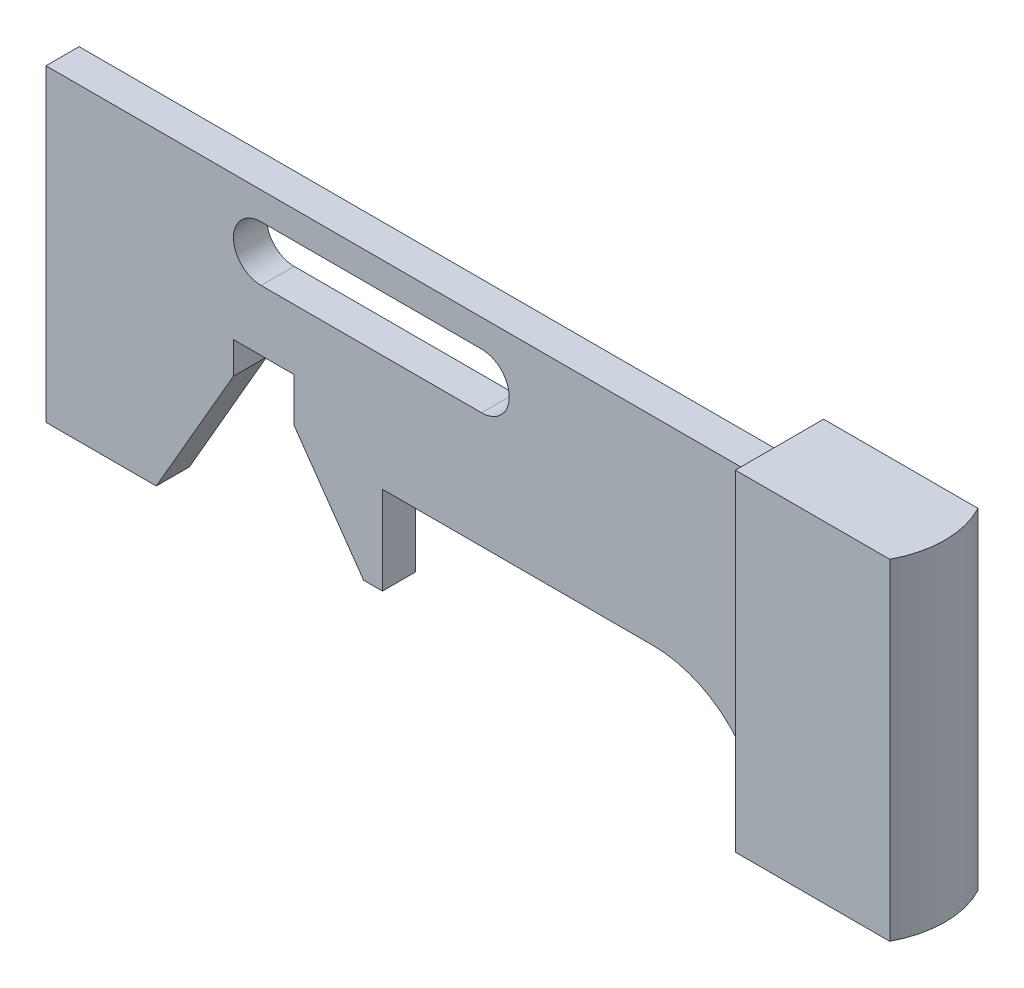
ISO-10303-21;
HEADER;
FILE_DESCRIPTION(('STEP AP214'),'2;1');
FILE_NAME('part.step','',(''),(''),'','','');
FILE_SCHEMA(('AUTOMOTIVE_DESIGN { 1 0 10303 214 1 1 1 1 }'));
ENDSEC;
DATA;
#1=APPLICATION_CONTEXT('core data for automotive mechanical design processes');
#2=APPLICATION_PROTOCOL_DEFINITION('international standard','automotive_design',2000,#1);
#3=PRODUCT_CONTEXT('',#1,'mechanical');
#4=PRODUCT('Part','Part','',(#3));
#5=PRODUCT_RELATED_PRODUCT_CATEGORY('part','',(#4));
#6=PRODUCT_DEFINITION_FORMATION('','',#4);
#7=PRODUCT_DEFINITION_CONTEXT('part definition',#1,'design');
#8=PRODUCT_DEFINITION('design','',#6,#7);
#9=PRODUCT_DEFINITION_SHAPE('','',#8);
#10=(LENGTH_UNIT() NAMED_UNIT(*) SI_UNIT(.MILLI.,.METRE.));
#11=(NAMED_UNIT(*) PLANE_ANGLE_UNIT() SI_UNIT($,.RADIAN.));
#12=(NAMED_UNIT(*) SI_UNIT($,.STERADIAN.) SOLID_ANGLE_UNIT());
#13=UNCERTAINTY_MEASURE_WITH_UNIT(LENGTH_MEASURE(1.E-05),#10,'distance_accuracy_value','');
#14=(GEOMETRIC_REPRESENTATION_CONTEXT(3) GLOBAL_UNCERTAINTY_ASSIGNED_CONTEXT((#13)) GLOBAL_UNIT_ASSIGNED_CONTEXT((#10,
#11,#12)) REPRESENTATION_CONTEXT('',''));
#15=CARTESIAN_POINT('',(0.,0.,0.));
#16=DIRECTION('',(0.,0.,1.));
#17=DIRECTION('',(1.,0.,0.));
#18=AXIS2_PLACEMENT_3D('',#15,#16,#17);
#19=CARTESIAN_POINT('',(71.5,0.,0.));
#20=DIRECTION('',(0.,-1.,0.));
#21=DIRECTION('',(0.,0.,-1.));
#22=AXIS2_PLACEMENT_3D('',#19,#20,#21);
#23=PLANE('',#22);
#24=DIRECTION('',(0.,0.,1.));
#25=VECTOR('',#24,1.);
#26=CARTESIAN_POINT('',(10.,0.,-1.5));
#27=LINE('',#26,#25);
#28=CARTESIAN_POINT('',(10.,0.,-1.5));
#29=VERTEX_POINT('',#28);
#30=CARTESIAN_POINT('',(10.,0.,1.5));
#31=VERTEX_POINT('',#30);
#32=EDGE_CURVE('E250',#29,#31,#27,.T.);
#33=ORIENTED_EDGE('',*,*,#32,.T.);
#34=DIRECTION('',(1.,0.,0.));
#35=VECTOR('',#34,1.);
#36=CARTESIAN_POINT('',(0.,0.,1.5));
#37=LINE('',#36,#35);
#38=CARTESIAN_POINT('',(0.,0.,1.5));
#39=VERTEX_POINT('',#38);
#40=EDGE_CURVE('E318',#39,#31,#37,.T.);
#41=ORIENTED_EDGE('',*,*,#40,.F.);
#42=DIRECTION('',(0.,0.,1.));
#43=VECTOR('',#42,1.);
#44=CARTESIAN_POINT('',(0.,0.,1.5));
#45=LINE('',#44,#43);
#46=CARTESIAN_POINT('',(0.,0.,-1.5));
#47=VERTEX_POINT('',#46);
#48=EDGE_CURVE('E299',#47,#39,#45,.T.);
#49=ORIENTED_EDGE('',*,*,#48,.F.);
#50=DIRECTION('',(-1.,0.,0.));
#51=VECTOR('',#50,1.);
#52=CARTESIAN_POINT('',(0.,0.,-1.5));
#53=LINE('',#52,#51);
#54=EDGE_CURVE('E308',#29,#47,#53,.T.);
#55=ORIENTED_EDGE('',*,*,#54,.F.);
#56=EDGE_LOOP('',(#33,#41,#49,#55));
#57=FACE_BOUND('',#56,.T.);
#58=ADVANCED_FACE('F37',(#57),#23,.T.);
#59=CARTESIAN_POINT('',(0.,30.,1.5));
#60=DIRECTION('',(1.,0.,0.));
#61=DIRECTION('',(0.,0.,-1.));
#62=AXIS2_PLACEMENT_3D('',#59,#60,#61);
#63=PLANE('',#62);
#64=DIRECTION('',(0.,-1.,0.));
#65=VECTOR('',#64,1.);
#66=CARTESIAN_POINT('',(0.,30.,1.5));
#67=LINE('',#66,#65);
#68=CARTESIAN_POINT('',(0.,28.,1.5));
#69=VERTEX_POINT('',#68);
#70=EDGE_CURVE('E11',#69,#39,#67,.T.);
#71=ORIENTED_EDGE('',*,*,#70,.F.);
#72=DIRECTION('',(0.,0.,1.));
#73=VECTOR('',#72,1.);
#74=CARTESIAN_POINT('',(0.,28.,-1.5));
#75=LINE('',#74,#73);
#76=CARTESIAN_POINT('',(0.,28.,-1.5));
#77=VERTEX_POINT('',#76);
#78=EDGE_CURVE('E270',#77,#69,#75,.T.);
#79=ORIENTED_EDGE('',*,*,#78,.F.);
#80=DIRECTION('',(0.,-1.,0.));
#81=VECTOR('',#80,1.);
#82=CARTESIAN_POINT('',(0.,30.,-1.5));
#83=LINE('',#82,#81);
#84=EDGE_CURVE('E315',#77,#47,#83,.T.);
#85=ORIENTED_EDGE('',*,*,#84,.T.);
#86=ORIENTED_EDGE('',*,*,#48,.T.);
#87=EDGE_LOOP('',(#71,#79,#85,#86));
#88=FACE_BOUND('',#87,.T.);
#89=ADVANCED_FACE('F39',(#88),#63,.F.);
#90=CARTESIAN_POINT('',(0.,30.,1.5));
#91=DIRECTION('',(0.,0.,-1.));
#92=DIRECTION('',(-1.,0.,0.));
#93=AXIS2_PLACEMENT_3D('',#90,#91,#92);
#94=PLANE('',#93);
#95=DIRECTION('',(1.,0.,0.));
#96=VECTOR('',#95,1.);
#97=CARTESIAN_POINT('',(19.5,20.5,1.5));
#98=LINE('',#97,#96);
#99=CARTESIAN_POINT('',(19.5,20.5,1.5));
#100=VERTEX_POINT('',#99);
#101=CARTESIAN_POINT('',(39.5,20.5,1.5));
#102=VERTEX_POINT('',#101);
#103=EDGE_CURVE('E289',#100,#102,#98,.T.);
#104=ORIENTED_EDGE('',*,*,#103,.F.);
#105=CARTESIAN_POINT('',(19.5,23.,1.5));
#106=DIRECTION('',(0.,0.,1.));
#107=DIRECTION('',(1.,0.,0.));
#108=AXIS2_PLACEMENT_3D('',#105,#106,#107);
#109=CIRCLE('',#108,2.5);
#110=CARTESIAN_POINT('',(19.5,25.5,1.5));
#111=VERTEX_POINT('',#110);
#112=EDGE_CURVE('E52',#111,#100,#109,.T.);
#113=ORIENTED_EDGE('',*,*,#112,.F.);
#114=DIRECTION('',(-1.,0.,0.));
#115=VECTOR('',#114,1.);
#116=CARTESIAN_POINT('',(19.5,25.5,1.5));
#117=LINE('',#116,#115);
#118=CARTESIAN_POINT('',(39.5,25.5,1.5));
#119=VERTEX_POINT('',#118);
#120=EDGE_CURVE('E280',#119,#111,#117,.T.);
#121=ORIENTED_EDGE('',*,*,#120,.F.);
#122=CARTESIAN_POINT('',(39.5,23.,1.5));
#123=DIRECTION('',(0.,0.,1.));
#124=DIRECTION('',(1.,0.,0.));
#125=AXIS2_PLACEMENT_3D('',#122,#123,#124);
#126=CIRCLE('',#125,2.5);
#127=EDGE_CURVE('E292',#102,#119,#126,.T.);
#128=ORIENTED_EDGE('',*,*,#127,.F.);
#129=EDGE_LOOP('',(#104,#113,#121,#128));
#130=FACE_BOUND('',#129,.T.);
#131=ORIENTED_EDGE('',*,*,#40,.T.);
#132=DIRECTION('',(-0.499999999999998,-0.86602540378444,0.));
#133=VECTOR('',#132,1.);
#134=CARTESIAN_POINT('',(10.,0.,1.5));
#135=LINE('',#134,#133);
#136=CARTESIAN_POINT('',(17.,12.1243556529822,1.5));
#137=VERTEX_POINT('',#136);
#138=EDGE_CURVE('E207',#137,#31,#135,.T.);
#139=ORIENTED_EDGE('',*,*,#138,.F.);
#140=DIRECTION('',(0.,-1.,0.));
#141=VECTOR('',#140,1.);
#142=CARTESIAN_POINT('',(17.,12.1243556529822,1.5));
#143=LINE('',#142,#141);
#144=CARTESIAN_POINT('',(17.,15.,1.5));
#145=VERTEX_POINT('',#144);
#146=EDGE_CURVE('E209',#145,#137,#143,.T.);
#147=ORIENTED_EDGE('',*,*,#146,.F.);
#148=DIRECTION('',(-1.,0.,0.));
#149=VECTOR('',#148,1.);
#150=CARTESIAN_POINT('',(17.,15.,1.5));
#151=LINE('',#150,#149);
#152=CARTESIAN_POINT('',(22.5,15.,1.5));
#153=VERTEX_POINT('',#152);
#154=EDGE_CURVE('E245',#153,#145,#151,.T.);
#155=ORIENTED_EDGE('',*,*,#154,.F.);
#156=DIRECTION('',(0.,1.,0.));
#157=VECTOR('',#156,1.);
#158=CARTESIAN_POINT('',(22.5,15.,1.5));
#159=LINE('',#158,#157);
#160=CARTESIAN_POINT('',(22.5,10.9973324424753,1.5));
#161=VERTEX_POINT('',#160);
#162=EDGE_CURVE('E242',#161,#153,#159,.T.);
#163=ORIENTED_EDGE('',*,*,#162,.F.);
#164=DIRECTION('',(-0.573576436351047,0.819152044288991,0.));
#165=VECTOR('',#164,1.);
#166=CARTESIAN_POINT('',(22.5,10.9973324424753,1.5));
#167=LINE('',#166,#165);
#168=CARTESIAN_POINT('',(28.8,2.,1.5));
#169=VERTEX_POINT('',#168);
#170=EDGE_CURVE('E239',#169,#161,#167,.T.);
#171=ORIENTED_EDGE('',*,*,#170,.F.);
#172=DIRECTION('',(-1.,0.,0.));
#173=VECTOR('',#172,1.);
#174=CARTESIAN_POINT('',(28.8,2.,1.5));
#175=LINE('',#174,#173);
#176=CARTESIAN_POINT('',(30.5,2.,1.5));
#177=VERTEX_POINT('',#176);
#178=EDGE_CURVE('E236',#177,#169,#175,.T.);
#179=ORIENTED_EDGE('',*,*,#178,.F.);
#180=DIRECTION('',(0.,-1.,0.));
#181=VECTOR('',#180,1.);
#182=CARTESIAN_POINT('',(30.5,2.,1.5));
#183=LINE('',#182,#181);
#184=CARTESIAN_POINT('',(30.5,10.,1.5));
#185=VERTEX_POINT('',#184);
#186=EDGE_CURVE('E233',#185,#177,#183,.T.);
#187=ORIENTED_EDGE('',*,*,#186,.F.);
#188=DIRECTION('',(-1.,0.,0.));
#189=VECTOR('',#188,1.);
#190=CARTESIAN_POINT('',(30.5,10.,1.5));
#191=LINE('',#190,#189);
#192=CARTESIAN_POINT('',(55.,10.,1.5));
#193=VERTEX_POINT('',#192);
#194=EDGE_CURVE('E231',#193,#185,#191,.T.);
#195=ORIENTED_EDGE('',*,*,#194,.F.);
#196=CARTESIAN_POINT('',(55.,0.,1.5));
#197=DIRECTION('',(0.,0.,1.));
#198=DIRECTION('',(-1.,0.,0.));
#199=AXIS2_PLACEMENT_3D('',#196,#197,#198);
#200=CIRCLE('',#199,10.);
#201=CARTESIAN_POINT('',(65.,0.,1.5));
#202=VERTEX_POINT('',#201);
#203=EDGE_CURVE('E185',#202,#193,#200,.T.);
#204=ORIENTED_EDGE('',*,*,#203,.F.);
#205=DIRECTION('',(0.,-1.,0.));
#206=VECTOR('',#205,1.);
#207=CARTESIAN_POINT('',(65.,30.,1.5));
#208=LINE('',#207,#206);
#209=CARTESIAN_POINT('',(65.,28.,1.5));
#210=VERTEX_POINT('',#209);
#211=EDGE_CURVE('E45',#210,#202,#208,.T.);
#212=ORIENTED_EDGE('',*,*,#211,.F.);
#213=DIRECTION('',(1.,0.,0.));
#214=VECTOR('',#213,1.);
#215=CARTESIAN_POINT('',(0.,28.,1.5));
#216=LINE('',#215,#214);
#217=EDGE_CURVE('E253',#69,#210,#216,.T.);
#218=ORIENTED_EDGE('',*,*,#217,.F.);
#219=ORIENTED_EDGE('',*,*,#70,.T.);
#220=EDGE_LOOP('',(#131,#139,#147,#155,#163,#171,#179,#187,#195,#204,#212,#218,#219));
#221=FACE_BOUND('',#220,.T.);
#222=ADVANCED_FACE('F388',(#130,#221),#94,.F.);
#223=CARTESIAN_POINT('',(65.,30.,4.));
#224=DIRECTION('',(0.,0.,-1.));
#225=DIRECTION('',(-1.,0.,0.));
#226=AXIS2_PLACEMENT_3D('',#223,#224,#225);
#227=PLANE('',#226);
#228=DIRECTION('',(1.,0.,0.));
#229=VECTOR('',#228,1.);
#230=CARTESIAN_POINT('',(65.,0.,4.));
#231=LINE('',#230,#229);
#232=CARTESIAN_POINT('',(65.,0.,4.));
#233=VERTEX_POINT('',#232);
#234=CARTESIAN_POINT('',(79.,0.,4.));
#235=VERTEX_POINT('',#234);
#236=EDGE_CURVE('E323',#233,#235,#231,.T.);
#237=ORIENTED_EDGE('',*,*,#236,.T.);
#238=DIRECTION('',(0.,-1.,0.));
#239=VECTOR('',#238,1.);
#240=CARTESIAN_POINT('',(79.,30.,4.));
#241=LINE('',#240,#239);
#242=CARTESIAN_POINT('',(79.,30.,4.));
#243=VERTEX_POINT('',#242);
#244=EDGE_CURVE('E341',#243,#235,#241,.T.);
#245=ORIENTED_EDGE('',*,*,#244,.F.);
#246=DIRECTION('',(1.,0.,0.));
#247=VECTOR('',#246,1.);
#248=CARTESIAN_POINT('',(65.,30.,4.));
#249=LINE('',#248,#247);
#250=CARTESIAN_POINT('',(65.,30.,4.));
#251=VERTEX_POINT('',#250);
#252=EDGE_CURVE('E307',#251,#243,#249,.T.);
#253=ORIENTED_EDGE('',*,*,#252,.F.);
#254=DIRECTION('',(0.,-1.,0.));
#255=VECTOR('',#254,1.);
#256=CARTESIAN_POINT('',(65.,30.,4.));
#257=LINE('',#256,#255);
#258=EDGE_CURVE('E344',#251,#233,#257,.T.);
#259=ORIENTED_EDGE('',*,*,#258,.T.);
#260=EDGE_LOOP('',(#237,#245,#253,#259));
#261=FACE_BOUND('',#260,.T.);
#262=ADVANCED_FACE('F362',(#261),#227,.F.);
#263=CARTESIAN_POINT('',(71.5,30.,0.));
#264=DIRECTION('',(0.,-1.,0.));
#265=DIRECTION('',(0.,0.,-1.));
#266=AXIS2_PLACEMENT_3D('',#263,#264,#265);
#267=CYLINDRICAL_SURFACE('',#266,8.49999999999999);
#268=CARTESIAN_POINT('',(71.5,0.,0.));
#269=DIRECTION('',(0.,1.,0.));
#270=DIRECTION('',(0.,0.,-1.));
#271=AXIS2_PLACEMENT_3D('',#268,#269,#270);
#272=CIRCLE('',#271,8.49999999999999);
#273=CARTESIAN_POINT('',(79.,0.,-4.));
#274=VERTEX_POINT('',#273);
#275=EDGE_CURVE('E325',#235,#274,#272,.T.);
#276=ORIENTED_EDGE('',*,*,#275,.T.);
#277=DIRECTION('',(0.,-1.,0.));
#278=VECTOR('',#277,1.);
#279=CARTESIAN_POINT('',(79.,30.,-4.));
#280=LINE('',#279,#278);
#281=CARTESIAN_POINT('',(79.,30.,-4.));
#282=VERTEX_POINT('',#281);
#283=EDGE_CURVE('E338',#282,#274,#280,.T.);
#284=ORIENTED_EDGE('',*,*,#283,.F.);
#285=CARTESIAN_POINT('',(71.5,30.,0.));
#286=DIRECTION('',(0.,1.,0.));
#287=DIRECTION('',(0.,0.,-1.));
#288=AXIS2_PLACEMENT_3D('',#285,#286,#287);
#289=CIRCLE('',#288,8.49999999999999);
#290=EDGE_CURVE('E310',#243,#282,#289,.T.);
#291=ORIENTED_EDGE('',*,*,#290,.F.);
#292=ORIENTED_EDGE('',*,*,#244,.T.);
#293=EDGE_LOOP('',(#276,#284,#291,#292));
#294=FACE_BOUND('',#293,.T.);
#295=ADVANCED_FACE('F366',(#294),#267,.T.);
#296=CARTESIAN_POINT('',(65.,30.,-4.));
#297=DIRECTION('',(0.,0.,1.));
#298=DIRECTION('',(1.,0.,0.));
#299=AXIS2_PLACEMENT_3D('',#296,#297,#298);
#300=PLANE('',#299);
#301=DIRECTION('',(-1.,0.,0.));
#302=VECTOR('',#301,1.);
#303=CARTESIAN_POINT('',(65.,0.,-4.));
#304=LINE('',#303,#302);
#305=CARTESIAN_POINT('',(65.,0.,-4.));
#306=VERTEX_POINT('',#305);
#307=EDGE_CURVE('E327',#274,#306,#304,.T.);
#308=ORIENTED_EDGE('',*,*,#307,.T.);
#309=DIRECTION('',(0.,-1.,0.));
#310=VECTOR('',#309,1.);
#311=CARTESIAN_POINT('',(65.,30.,-4.));
#312=LINE('',#311,#310);
#313=CARTESIAN_POINT('',(65.,30.,-4.));
#314=VERTEX_POINT('',#313);
#315=EDGE_CURVE('E335',#314,#306,#312,.T.);
#316=ORIENTED_EDGE('',*,*,#315,.F.);
#317=DIRECTION('',(-1.,0.,0.));
#318=VECTOR('',#317,1.);
#319=CARTESIAN_POINT('',(65.,30.,-4.));
#320=LINE('',#319,#318);
#321=EDGE_CURVE('E312',#282,#314,#320,.T.);
#322=ORIENTED_EDGE('',*,*,#321,.F.);
#323=ORIENTED_EDGE('',*,*,#283,.T.);
#324=EDGE_LOOP('',(#308,#316,#322,#323));
#325=FACE_BOUND('',#324,.T.);
#326=ADVANCED_FACE('F373',(#325),#300,.F.);
#327=CARTESIAN_POINT('',(65.,30.,-1.5));
#328=DIRECTION('',(1.,0.,0.));
#329=DIRECTION('',(0.,0.,-1.));
#330=AXIS2_PLACEMENT_3D('',#327,#328,#329);
#331=PLANE('',#330);
#332=DIRECTION('',(0.,0.,1.));
#333=VECTOR('',#332,1.);
#334=CARTESIAN_POINT('',(65.,0.,-1.5));
#335=LINE('',#334,#333);
#336=CARTESIAN_POINT('',(65.,0.,-1.5));
#337=VERTEX_POINT('',#336);
#338=EDGE_CURVE('E329',#306,#337,#335,.T.);
#339=ORIENTED_EDGE('',*,*,#338,.T.);
#340=DIRECTION('',(0.,-1.,0.));
#341=VECTOR('',#340,1.);
#342=CARTESIAN_POINT('',(65.,30.,-1.5));
#343=LINE('',#342,#341);
#344=CARTESIAN_POINT('',(65.,28.,-1.5));
#345=VERTEX_POINT('',#344);
#346=EDGE_CURVE('E205',#345,#337,#343,.T.);
#347=ORIENTED_EDGE('',*,*,#346,.F.);
#348=DIRECTION('',(0.,0.,1.));
#349=VECTOR('',#348,1.);
#350=CARTESIAN_POINT('',(65.,28.,-1.5));
#351=LINE('',#350,#349);
#352=EDGE_CURVE('E273',#345,#210,#351,.T.);
#353=ORIENTED_EDGE('',*,*,#352,.T.);
#354=ORIENTED_EDGE('',*,*,#211,.T.);
#355=DIRECTION('',(0.,0.,1.));
#356=VECTOR('',#355,1.);
#357=CARTESIAN_POINT('',(65.,0.,1.5));
#358=LINE('',#357,#356);
#359=EDGE_CURVE('E321',#202,#233,#358,.T.);
#360=ORIENTED_EDGE('',*,*,#359,.T.);
#361=ORIENTED_EDGE('',*,*,#258,.F.);
#362=DIRECTION('',(0.,0.,1.));
#363=VECTOR('',#362,1.);
#364=CARTESIAN_POINT('',(65.,30.,1.5));
#365=LINE('',#364,#363);
#366=EDGE_CURVE('E305',#314,#251,#365,.T.);
#367=ORIENTED_EDGE('',*,*,#366,.F.);
#368=ORIENTED_EDGE('',*,*,#315,.T.);
#369=EDGE_LOOP('',(#339,#347,#353,#354,#360,#361,#367,#368));
#370=FACE_BOUND('',#369,.T.);
#371=ADVANCED_FACE('F350',(#370),#331,.F.);
#372=CARTESIAN_POINT('',(0.,30.,-1.5));
#373=DIRECTION('',(0.,0.,1.));
#374=DIRECTION('',(1.,0.,0.));
#375=AXIS2_PLACEMENT_3D('',#372,#373,#374);
#376=PLANE('',#375);
#377=DIRECTION('',(-1.,0.,0.));
#378=VECTOR('',#377,1.);
#379=CARTESIAN_POINT('',(19.5,25.5,-1.5));
#380=LINE('',#379,#378);
#381=CARTESIAN_POINT('',(39.5,25.5,-1.5));
#382=VERTEX_POINT('',#381);
#383=CARTESIAN_POINT('',(19.5,25.5,-1.5));
#384=VERTEX_POINT('',#383);
#385=EDGE_CURVE('E284',#382,#384,#380,.T.);
#386=ORIENTED_EDGE('',*,*,#385,.T.);
#387=CARTESIAN_POINT('',(19.5,23.,-1.5));
#388=DIRECTION('',(0.,0.,1.));
#389=DIRECTION('',(1.,0.,0.));
#390=AXIS2_PLACEMENT_3D('',#387,#388,#389);
#391=CIRCLE('',#390,2.5);
#392=CARTESIAN_POINT('',(19.5,20.5,-1.5));
#393=VERTEX_POINT('',#392);
#394=EDGE_CURVE('E276',#384,#393,#391,.T.);
#395=ORIENTED_EDGE('',*,*,#394,.T.);
#396=DIRECTION('',(1.,0.,0.));
#397=VECTOR('',#396,1.);
#398=CARTESIAN_POINT('',(19.5,20.5,-1.5));
#399=LINE('',#398,#397);
#400=CARTESIAN_POINT('',(39.5,20.5,-1.5));
#401=VERTEX_POINT('',#400);
#402=EDGE_CURVE('E279',#393,#401,#399,.T.);
#403=ORIENTED_EDGE('',*,*,#402,.T.);
#404=CARTESIAN_POINT('',(39.5,23.,-1.5));
#405=DIRECTION('',(0.,0.,1.));
#406=DIRECTION('',(1.,0.,0.));
#407=AXIS2_PLACEMENT_3D('',#404,#405,#406);
#408=CIRCLE('',#407,2.5);
#409=EDGE_CURVE('E60',#401,#382,#408,.T.);
#410=ORIENTED_EDGE('',*,*,#409,.T.);
#411=EDGE_LOOP('',(#386,#395,#403,#410));
#412=FACE_BOUND('',#411,.T.);
#413=DIRECTION('',(0.,-1.,0.));
#414=VECTOR('',#413,1.);
#415=CARTESIAN_POINT('',(17.,12.1243556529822,-1.5));
#416=LINE('',#415,#414);
#417=CARTESIAN_POINT('',(17.,15.,-1.5));
#418=VERTEX_POINT('',#417);
#419=CARTESIAN_POINT('',(17.,12.1243556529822,-1.5));
#420=VERTEX_POINT('',#419);
#421=EDGE_CURVE('E225',#418,#420,#416,.T.);
#422=ORIENTED_EDGE('',*,*,#421,.T.);
#423=DIRECTION('',(-0.499999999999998,-0.86602540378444,0.));
#424=VECTOR('',#423,1.);
#425=CARTESIAN_POINT('',(10.,0.,-1.5));
#426=LINE('',#425,#424);
#427=EDGE_CURVE('E227',#420,#29,#426,.T.);
#428=ORIENTED_EDGE('',*,*,#427,.T.);
#429=ORIENTED_EDGE('',*,*,#54,.T.);
#430=ORIENTED_EDGE('',*,*,#84,.F.);
#431=DIRECTION('',(1.,0.,0.));
#432=VECTOR('',#431,1.);
#433=CARTESIAN_POINT('',(0.,28.,-1.5));
#434=LINE('',#433,#432);
#435=EDGE_CURVE('E268',#77,#345,#434,.T.);
#436=ORIENTED_EDGE('',*,*,#435,.T.);
#437=ORIENTED_EDGE('',*,*,#346,.T.);
#438=CARTESIAN_POINT('',(55.,0.,-1.5));
#439=DIRECTION('',(0.,0.,1.));
#440=DIRECTION('',(-1.,0.,0.));
#441=AXIS2_PLACEMENT_3D('',#438,#439,#440);
#442=CIRCLE('',#441,10.);
#443=CARTESIAN_POINT('',(55.,10.,-1.5));
#444=VERTEX_POINT('',#443);
#445=EDGE_CURVE('E182',#337,#444,#442,.T.);
#446=ORIENTED_EDGE('',*,*,#445,.T.);
#447=DIRECTION('',(-1.,0.,0.));
#448=VECTOR('',#447,1.);
#449=CARTESIAN_POINT('',(30.5,10.,-1.5));
#450=LINE('',#449,#448);
#451=CARTESIAN_POINT('',(30.5,10.,-1.5));
#452=VERTEX_POINT('',#451);
#453=EDGE_CURVE('E193',#444,#452,#450,.T.);
#454=ORIENTED_EDGE('',*,*,#453,.T.);
#455=DIRECTION('',(0.,-1.,0.));
#456=VECTOR('',#455,1.);
#457=CARTESIAN_POINT('',(30.5,2.,-1.5));
#458=LINE('',#457,#456);
#459=CARTESIAN_POINT('',(30.5,2.,-1.5));
#460=VERTEX_POINT('',#459);
#461=EDGE_CURVE('E198',#452,#460,#458,.T.);
#462=ORIENTED_EDGE('',*,*,#461,.T.);
#463=DIRECTION('',(-1.,0.,0.));
#464=VECTOR('',#463,1.);
#465=CARTESIAN_POINT('',(28.8,2.,-1.5));
#466=LINE('',#465,#464);
#467=CARTESIAN_POINT('',(28.8,2.,-1.5));
#468=VERTEX_POINT('',#467);
#469=EDGE_CURVE('E213',#460,#468,#466,.T.);
#470=ORIENTED_EDGE('',*,*,#469,.T.);
#471=DIRECTION('',(-0.573576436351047,0.819152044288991,0.));
#472=VECTOR('',#471,1.);
#473=CARTESIAN_POINT('',(22.5,10.9973324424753,-1.5));
#474=LINE('',#473,#472);
#475=CARTESIAN_POINT('',(22.5,10.9973324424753,-1.5));
#476=VERTEX_POINT('',#475);
#477=EDGE_CURVE('E216',#468,#476,#474,.T.);
#478=ORIENTED_EDGE('',*,*,#477,.T.);
#479=DIRECTION('',(0.,1.,0.));
#480=VECTOR('',#479,1.);
#481=CARTESIAN_POINT('',(22.5,15.,-1.5));
#482=LINE('',#481,#480);
#483=CARTESIAN_POINT('',(22.5,15.,-1.5));
#484=VERTEX_POINT('',#483);
#485=EDGE_CURVE('E219',#476,#484,#482,.T.);
#486=ORIENTED_EDGE('',*,*,#485,.T.);
#487=DIRECTION('',(-1.,0.,0.));
#488=VECTOR('',#487,1.);
#489=CARTESIAN_POINT('',(17.,15.,-1.5));
#490=LINE('',#489,#488);
#491=EDGE_CURVE('E222',#484,#418,#490,.T.);
#492=ORIENTED_EDGE('',*,*,#491,.T.);
#493=EDGE_LOOP('',(#422,#428,#429,#430,#436,#437,#446,#454,#462,#470,#478,#486,#492));
#494=FACE_BOUND('',#493,.T.);
#495=ADVANCED_FACE('F202',(#412,#494),#376,.F.);
#496=CARTESIAN_POINT('',(71.5,30.,0.));
#497=DIRECTION('',(0.,-1.,0.));
#498=DIRECTION('',(0.,0.,-1.));
#499=AXIS2_PLACEMENT_3D('',#496,#497,#498);
#500=PLANE('',#499);
#501=ORIENTED_EDGE('',*,*,#321,.T.);
#502=ORIENTED_EDGE('',*,*,#366,.T.);
#503=ORIENTED_EDGE('',*,*,#252,.T.);
#504=ORIENTED_EDGE('',*,*,#290,.T.);
#505=EDGE_LOOP('',(#501,#502,#503,#504));
#506=FACE_BOUND('',#505,.T.);
#507=ADVANCED_FACE('F370',(#506),#500,.F.);
#508=DIRECTION('',(0.,0.,1.));
#509=VECTOR('',#508,1.);
#510=CARTESIAN_POINT('',(65.,0.,-1.5));
#511=LINE('',#510,#509);
#512=EDGE_CURVE('E190',#337,#202,#511,.T.);
#513=ORIENTED_EDGE('',*,*,#512,.F.);
#514=ORIENTED_EDGE('',*,*,#338,.F.);
#515=ORIENTED_EDGE('',*,*,#307,.F.);
#516=ORIENTED_EDGE('',*,*,#275,.F.);
#517=ORIENTED_EDGE('',*,*,#236,.F.);
#518=ORIENTED_EDGE('',*,*,#359,.F.);
#519=EDGE_LOOP('',(#513,#514,#515,#516,#517,#518));
#520=FACE_BOUND('',#519,.T.);
#521=ADVANCED_FACE('F356',(#520),#23,.T.);
#522=CARTESIAN_POINT('',(19.5,23.,-1.5));
#523=DIRECTION('',(0.,0.,1.));
#524=DIRECTION('',(1.,0.,0.));
#525=AXIS2_PLACEMENT_3D('',#522,#523,#524);
#526=CYLINDRICAL_SURFACE('',#525,2.5);
#527=ORIENTED_EDGE('',*,*,#112,.T.);
#528=DIRECTION('',(0.,0.,1.));
#529=VECTOR('',#528,1.);
#530=CARTESIAN_POINT('',(19.5,20.5,-1.5));
#531=LINE('',#530,#529);
#532=EDGE_CURVE('E287',#393,#100,#531,.T.);
#533=ORIENTED_EDGE('',*,*,#532,.F.);
#534=ORIENTED_EDGE('',*,*,#394,.F.);
#535=DIRECTION('',(0.,0.,1.));
#536=VECTOR('',#535,1.);
#537=CARTESIAN_POINT('',(19.5,25.5,-1.5));
#538=LINE('',#537,#536);
#539=EDGE_CURVE('E297',#384,#111,#538,.T.);
#540=ORIENTED_EDGE('',*,*,#539,.T.);
#541=EDGE_LOOP('',(#527,#533,#534,#540));
#542=FACE_BOUND('',#541,.T.);
#543=ADVANCED_FACE('F393',(#542),#526,.F.);
#544=CARTESIAN_POINT('',(19.5,25.5,-1.5));
#545=DIRECTION('',(0.,1.,0.));
#546=DIRECTION('',(0.,0.,1.));
#547=AXIS2_PLACEMENT_3D('',#544,#545,#546);
#548=PLANE('',#547);
#549=ORIENTED_EDGE('',*,*,#120,.T.);
#550=ORIENTED_EDGE('',*,*,#539,.F.);
#551=ORIENTED_EDGE('',*,*,#385,.F.);
#552=DIRECTION('',(0.,0.,1.));
#553=VECTOR('',#552,1.);
#554=CARTESIAN_POINT('',(39.5,25.5,-1.5));
#555=LINE('',#554,#553);
#556=EDGE_CURVE('E300',#382,#119,#555,.T.);
#557=ORIENTED_EDGE('',*,*,#556,.T.);
#558=EDGE_LOOP('',(#549,#550,#551,#557));
#559=FACE_BOUND('',#558,.T.);
#560=ADVANCED_FACE('F398',(#559),#548,.F.);
#561=CARTESIAN_POINT('',(39.5,23.,-1.5));
#562=DIRECTION('',(0.,0.,1.));
#563=DIRECTION('',(1.,0.,0.));
#564=AXIS2_PLACEMENT_3D('',#561,#562,#563);
#565=CYLINDRICAL_SURFACE('',#564,2.5);
#566=ORIENTED_EDGE('',*,*,#127,.T.);
#567=ORIENTED_EDGE('',*,*,#556,.F.);
#568=ORIENTED_EDGE('',*,*,#409,.F.);
#569=DIRECTION('',(0.,0.,1.));
#570=VECTOR('',#569,1.);
#571=CARTESIAN_POINT('',(39.5,20.5,-1.5));
#572=LINE('',#571,#570);
#573=EDGE_CURVE('E302',#401,#102,#572,.T.);
#574=ORIENTED_EDGE('',*,*,#573,.T.);
#575=EDGE_LOOP('',(#566,#567,#568,#574));
#576=FACE_BOUND('',#575,.T.);
#577=ADVANCED_FACE('F409',(#576),#565,.F.);
#578=CARTESIAN_POINT('',(19.5,20.5,-1.5));
#579=DIRECTION('',(0.,-1.,0.));
#580=DIRECTION('',(0.,0.,-1.));
#581=AXIS2_PLACEMENT_3D('',#578,#579,#580);
#582=PLANE('',#581);
#583=ORIENTED_EDGE('',*,*,#103,.T.);
#584=ORIENTED_EDGE('',*,*,#573,.F.);
#585=ORIENTED_EDGE('',*,*,#402,.F.);
#586=ORIENTED_EDGE('',*,*,#532,.T.);
#587=EDGE_LOOP('',(#583,#584,#585,#586));
#588=FACE_BOUND('',#587,.T.);
#589=ADVANCED_FACE('F405',(#588),#582,.F.);
#590=CARTESIAN_POINT('',(0.,28.,-1.5));
#591=DIRECTION('',(0.,-1.,0.));
#592=DIRECTION('',(0.,0.,-1.));
#593=AXIS2_PLACEMENT_3D('',#590,#591,#592);
#594=PLANE('',#593);
#595=ORIENTED_EDGE('',*,*,#217,.T.);
#596=ORIENTED_EDGE('',*,*,#352,.F.);
#597=ORIENTED_EDGE('',*,*,#435,.F.);
#598=ORIENTED_EDGE('',*,*,#78,.T.);
#599=EDGE_LOOP('',(#595,#596,#597,#598));
#600=FACE_BOUND('',#599,.T.);
#601=ADVANCED_FACE('F408',(#600),#594,.F.);
#602=CARTESIAN_POINT('',(10.,0.,-1.5));
#603=DIRECTION('',(-0.86602540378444,0.499999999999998,0.));
#604=DIRECTION('',(-0.499999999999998,-0.86602540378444,0.));
#605=AXIS2_PLACEMENT_3D('',#602,#603,#604);
#606=PLANE('',#605);
#607=ORIENTED_EDGE('',*,*,#138,.T.);
#608=ORIENTED_EDGE('',*,*,#32,.F.);
#609=ORIENTED_EDGE('',*,*,#427,.F.);
#610=DIRECTION('',(0.,0.,1.));
#611=VECTOR('',#610,1.);
#612=CARTESIAN_POINT('',(17.,12.1243556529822,-1.5));
#613=LINE('',#612,#611);
#614=EDGE_CURVE('E254',#420,#137,#613,.T.);
#615=ORIENTED_EDGE('',*,*,#614,.T.);
#616=EDGE_LOOP('',(#607,#608,#609,#615));
#617=FACE_BOUND('',#616,.T.);
#618=ADVANCED_FACE('F418',(#617),#606,.F.);
#619=CARTESIAN_POINT('',(17.,12.1243556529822,-1.5));
#620=DIRECTION('',(-1.,0.,0.));
#621=DIRECTION('',(0.,0.,1.));
#622=AXIS2_PLACEMENT_3D('',#619,#620,#621);
#623=PLANE('',#622);
#624=ORIENTED_EDGE('',*,*,#146,.T.);
#625=ORIENTED_EDGE('',*,*,#614,.F.);
#626=ORIENTED_EDGE('',*,*,#421,.F.);
#627=DIRECTION('',(0.,0.,1.));
#628=VECTOR('',#627,1.);
#629=CARTESIAN_POINT('',(17.,15.,-1.5));
#630=LINE('',#629,#628);
#631=EDGE_CURVE('E256',#418,#145,#630,.T.);
#632=ORIENTED_EDGE('',*,*,#631,.T.);
#633=EDGE_LOOP('',(#624,#625,#626,#632));
#634=FACE_BOUND('',#633,.T.);
#635=ADVANCED_FACE('F443',(#634),#623,.F.);
#636=CARTESIAN_POINT('',(17.,15.,-1.5));
#637=DIRECTION('',(0.,1.,0.));
#638=DIRECTION('',(0.,0.,1.));
#639=AXIS2_PLACEMENT_3D('',#636,#637,#638);
#640=PLANE('',#639);
#641=ORIENTED_EDGE('',*,*,#154,.T.);
#642=ORIENTED_EDGE('',*,*,#631,.F.);
#643=ORIENTED_EDGE('',*,*,#491,.F.);
#644=DIRECTION('',(0.,0.,1.));
#645=VECTOR('',#644,1.);
#646=CARTESIAN_POINT('',(22.5,15.,-1.5));
#647=LINE('',#646,#645);
#648=EDGE_CURVE('E258',#484,#153,#647,.T.);
#649=ORIENTED_EDGE('',*,*,#648,.T.);
#650=EDGE_LOOP('',(#641,#642,#643,#649));
#651=FACE_BOUND('',#650,.T.);
#652=ADVANCED_FACE('F439',(#651),#640,.F.);
#653=CARTESIAN_POINT('',(22.5,15.,-1.5));
#654=DIRECTION('',(1.,0.,0.));
#655=DIRECTION('',(0.,0.,-1.));
#656=AXIS2_PLACEMENT_3D('',#653,#654,#655);
#657=PLANE('',#656);
#658=ORIENTED_EDGE('',*,*,#162,.T.);
#659=ORIENTED_EDGE('',*,*,#648,.F.);
#660=ORIENTED_EDGE('',*,*,#485,.F.);
#661=DIRECTION('',(0.,0.,1.));
#662=VECTOR('',#661,1.);
#663=CARTESIAN_POINT('',(22.5,10.9973324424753,-1.5));
#664=LINE('',#663,#662);
#665=EDGE_CURVE('E260',#476,#161,#664,.T.);
#666=ORIENTED_EDGE('',*,*,#665,.T.);
#667=EDGE_LOOP('',(#658,#659,#660,#666));
#668=FACE_BOUND('',#667,.T.);
#669=ADVANCED_FACE('F435',(#668),#657,.F.);
#670=CARTESIAN_POINT('',(22.5,10.9973324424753,-1.5));
#671=DIRECTION('',(0.819152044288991,0.573576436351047,0.));
#672=DIRECTION('',(-0.573576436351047,0.819152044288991,0.));
#673=AXIS2_PLACEMENT_3D('',#670,#671,#672);
#674=PLANE('',#673);
#675=ORIENTED_EDGE('',*,*,#170,.T.);
#676=ORIENTED_EDGE('',*,*,#665,.F.);
#677=ORIENTED_EDGE('',*,*,#477,.F.);
#678=DIRECTION('',(0.,0.,1.));
#679=VECTOR('',#678,1.);
#680=CARTESIAN_POINT('',(28.8,2.,-1.5));
#681=LINE('',#680,#679);
#682=EDGE_CURVE('E262',#468,#169,#681,.T.);
#683=ORIENTED_EDGE('',*,*,#682,.T.);
#684=EDGE_LOOP('',(#675,#676,#677,#683));
#685=FACE_BOUND('',#684,.T.);
#686=ADVANCED_FACE('F431',(#685),#674,.F.);
#687=CARTESIAN_POINT('',(28.8,2.,-1.5));
#688=DIRECTION('',(0.,1.,0.));
#689=DIRECTION('',(0.,0.,1.));
#690=AXIS2_PLACEMENT_3D('',#687,#688,#689);
#691=PLANE('',#690);
#692=ORIENTED_EDGE('',*,*,#178,.T.);
#693=ORIENTED_EDGE('',*,*,#682,.F.);
#694=ORIENTED_EDGE('',*,*,#469,.F.);
#695=DIRECTION('',(0.,0.,1.));
#696=VECTOR('',#695,1.);
#697=CARTESIAN_POINT('',(30.5,2.,-1.5));
#698=LINE('',#697,#696);
#699=EDGE_CURVE('E264',#460,#177,#698,.T.);
#700=ORIENTED_EDGE('',*,*,#699,.T.);
#701=EDGE_LOOP('',(#692,#693,#694,#700));
#702=FACE_BOUND('',#701,.T.);
#703=ADVANCED_FACE('F427',(#702),#691,.F.);
#704=CARTESIAN_POINT('',(30.5,2.,-1.5));
#705=DIRECTION('',(-1.,0.,0.));
#706=DIRECTION('',(0.,0.,1.));
#707=AXIS2_PLACEMENT_3D('',#704,#705,#706);
#708=PLANE('',#707);
#709=ORIENTED_EDGE('',*,*,#186,.T.);
#710=ORIENTED_EDGE('',*,*,#699,.F.);
#711=ORIENTED_EDGE('',*,*,#461,.F.);
#712=DIRECTION('',(0.,0.,1.));
#713=VECTOR('',#712,1.);
#714=CARTESIAN_POINT('',(30.5,10.,-1.5));
#715=LINE('',#714,#713);
#716=EDGE_CURVE('E189',#452,#185,#715,.T.);
#717=ORIENTED_EDGE('',*,*,#716,.T.);
#718=EDGE_LOOP('',(#709,#710,#711,#717));
#719=FACE_BOUND('',#718,.T.);
#720=ADVANCED_FACE('F424',(#719),#708,.F.);
#721=CARTESIAN_POINT('',(30.5,10.,-1.5));
#722=DIRECTION('',(0.,1.,0.));
#723=DIRECTION('',(0.,0.,1.));
#724=AXIS2_PLACEMENT_3D('',#721,#722,#723);
#725=PLANE('',#724);
#726=ORIENTED_EDGE('',*,*,#194,.T.);
#727=ORIENTED_EDGE('',*,*,#716,.F.);
#728=ORIENTED_EDGE('',*,*,#453,.F.);
#729=DIRECTION('',(0.,0.,1.));
#730=VECTOR('',#729,1.);
#731=CARTESIAN_POINT('',(55.,10.,-1.5));
#732=LINE('',#731,#730);
#733=EDGE_CURVE('E178',#444,#193,#732,.T.);
#734=ORIENTED_EDGE('',*,*,#733,.T.);
#735=EDGE_LOOP('',(#726,#727,#728,#734));
#736=FACE_BOUND('',#735,.T.);
#737=ADVANCED_FACE('F194',(#736),#725,.F.);
#738=CARTESIAN_POINT('',(55.,0.,-1.5));
#739=DIRECTION('',(0.,0.,1.));
#740=DIRECTION('',(1.,0.,0.));
#741=AXIS2_PLACEMENT_3D('',#738,#739,#740);
#742=CYLINDRICAL_SURFACE('',#741,10.);
#743=ORIENTED_EDGE('',*,*,#203,.T.);
#744=ORIENTED_EDGE('',*,*,#733,.F.);
#745=ORIENTED_EDGE('',*,*,#445,.F.);
#746=ORIENTED_EDGE('',*,*,#512,.T.);
#747=EDGE_LOOP('',(#743,#744,#745,#746));
#748=FACE_BOUND('',#747,.T.);
#749=ADVANCED_FACE('F180',(#748),#742,.F.);
#750=CLOSED_SHELL('',(#58,#89,#222,#262,#295,#326,#371,#495,#507,#521,#543,#560,#577,#589,#601,
#618,#635,#652,#669,#686,#703,#720,#737,#749));
#751=MANIFOLD_SOLID_BREP('B2',#750);
#752=ADVANCED_BREP_SHAPE_REPRESENTATION('',(#18,#751),#14);
#753=SHAPE_DEFINITION_REPRESENTATION(#9,#752);
ENDSEC;
END-ISO-10303-21;
